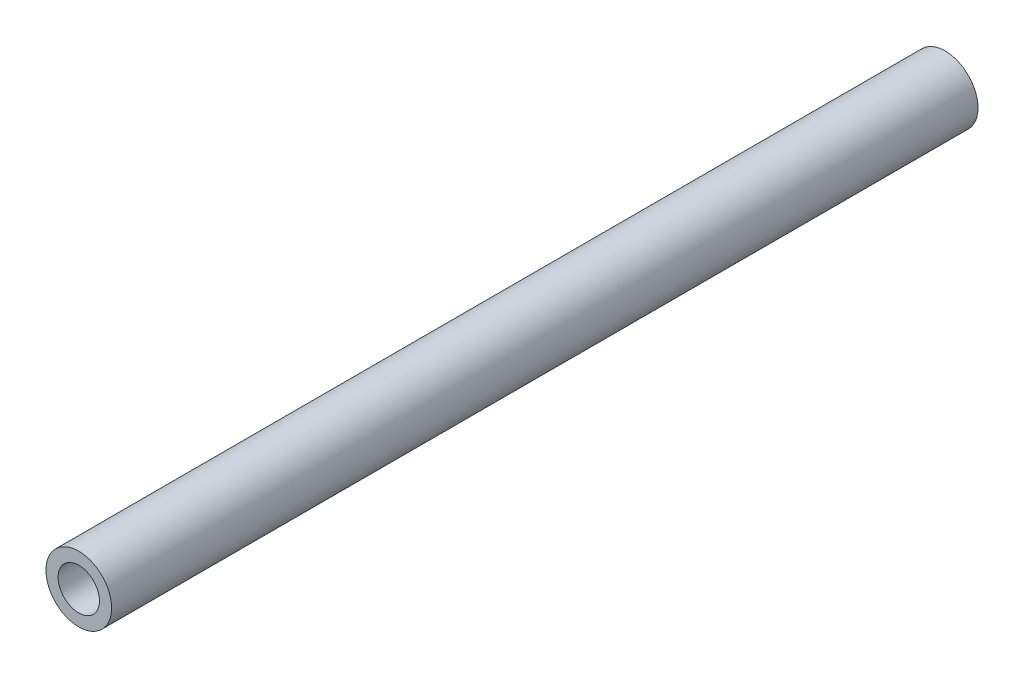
from build123d import *

# Parameters (mm, degrees)
SKETCH1_R      = 3.175
SKETCH1_R_2    = 2
EXTRUDE1_DEPTH = 83.7814


with BuildPart() as part:
    # Sketch1 → Extrude1 (new body)
    with BuildSketch(Plane.XY):
        with Locations((97.575623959, -340.286640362)):
            Circle(SKETCH1_R)
        with Locations((97.575623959, -340.286640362)):
            Circle(SKETCH1_R_2, mode=Mode.SUBTRACT)
    extrude(amount=EXTRUDE1_DEPTH)


solid = part.part
